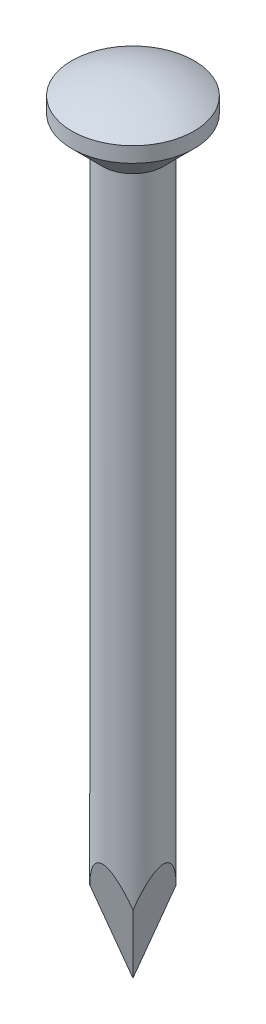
ISO-10303-21;
HEADER;
FILE_DESCRIPTION(('STEP AP214'),'2;1');
FILE_NAME('part.step','',(''),(''),'','','');
FILE_SCHEMA(('AUTOMOTIVE_DESIGN { 1 0 10303 214 1 1 1 1 }'));
ENDSEC;
DATA;
#1=APPLICATION_CONTEXT('core data for automotive mechanical design processes');
#2=APPLICATION_PROTOCOL_DEFINITION('international standard','automotive_design',2000,#1);
#3=PRODUCT_CONTEXT('',#1,'mechanical');
#4=PRODUCT('Part','Part','',(#3));
#5=PRODUCT_RELATED_PRODUCT_CATEGORY('part','',(#4));
#6=PRODUCT_DEFINITION_FORMATION('','',#4);
#7=PRODUCT_DEFINITION_CONTEXT('part definition',#1,'design');
#8=PRODUCT_DEFINITION('design','',#6,#7);
#9=PRODUCT_DEFINITION_SHAPE('','',#8);
#10=(LENGTH_UNIT() NAMED_UNIT(*) SI_UNIT(.MILLI.,.METRE.));
#11=(NAMED_UNIT(*) PLANE_ANGLE_UNIT() SI_UNIT($,.RADIAN.));
#12=(NAMED_UNIT(*) SI_UNIT($,.STERADIAN.) SOLID_ANGLE_UNIT());
#13=UNCERTAINTY_MEASURE_WITH_UNIT(LENGTH_MEASURE(1.E-05),#10,'distance_accuracy_value','');
#14=(GEOMETRIC_REPRESENTATION_CONTEXT(3) GLOBAL_UNCERTAINTY_ASSIGNED_CONTEXT((#13)) GLOBAL_UNIT_ASSIGNED_CONTEXT((#10,
#11,#12)) REPRESENTATION_CONTEXT('',''));
#15=CARTESIAN_POINT('',(0.,0.,0.));
#16=DIRECTION('',(0.,0.,1.));
#17=DIRECTION('',(1.,0.,0.));
#18=AXIS2_PLACEMENT_3D('',#15,#16,#17);
#19=CARTESIAN_POINT('',(0.,0.,0.));
#20=DIRECTION('',(0.,1.,0.));
#21=DIRECTION('',(-1.,0.,0.));
#22=AXIS2_PLACEMENT_3D('',#19,#20,#21);
#23=PLANE('',#22);
#24=DIRECTION('',(0.,0.,1.));
#25=VECTOR('',#24,1.);
#26=CARTESIAN_POINT('',(0.000999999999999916,0.,-2.5));
#27=LINE('',#26,#25);
#28=CARTESIAN_POINT('',(0.000999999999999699,0.,-0.00100000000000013));
#29=VERTEX_POINT('',#28);
#30=CARTESIAN_POINT('',(0.000999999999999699,0.,0.00100000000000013));
#31=VERTEX_POINT('',#30);
#32=EDGE_CURVE('E87',#29,#31,#27,.T.);
#33=ORIENTED_EDGE('',*,*,#32,.T.);
#34=DIRECTION('',(-1.,0.,0.));
#35=VECTOR('',#34,1.);
#36=CARTESIAN_POINT('',(2.5,0.,0.00100000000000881));
#37=LINE('',#36,#35);
#38=CARTESIAN_POINT('',(-0.000999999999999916,0.,0.00100000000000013));
#39=VERTEX_POINT('',#38);
#40=EDGE_CURVE('E79',#31,#39,#37,.T.);
#41=ORIENTED_EDGE('',*,*,#40,.T.);
#42=DIRECTION('',(0.,0.,-1.));
#43=VECTOR('',#42,1.);
#44=CARTESIAN_POINT('',(-0.00100000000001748,0.,2.5));
#45=LINE('',#44,#43);
#46=CARTESIAN_POINT('',(-0.000999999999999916,0.,-0.00100000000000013));
#47=VERTEX_POINT('',#46);
#48=EDGE_CURVE('E68',#39,#47,#45,.T.);
#49=ORIENTED_EDGE('',*,*,#48,.T.);
#50=DIRECTION('',(1.,0.,0.));
#51=VECTOR('',#50,1.);
#52=CARTESIAN_POINT('',(-2.5,0.,-0.00100000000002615));
#53=LINE('',#52,#51);
#54=EDGE_CURVE('E70',#47,#29,#53,.T.);
#55=ORIENTED_EDGE('',*,*,#54,.T.);
#56=EDGE_LOOP('',(#33,#41,#49,#55));
#57=FACE_BOUND('',#56,.T.);
#58=ADVANCED_FACE('F22',(#57),#23,.F.);
#59=CARTESIAN_POINT('',(0.,31.5099229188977,0.));
#60=DIRECTION('',(0.,1.,0.));
#61=DIRECTION('',(-1.,0.,0.));
#62=AXIS2_PLACEMENT_3D('',#59,#60,#61);
#63=CYLINDRICAL_SURFACE('',#62,1.);
#64=CARTESIAN_POINT('',(0.,23.5,0.));
#65=DIRECTION('',(0.,1.,0.));
#66=DIRECTION('',(-1.,0.,0.));
#67=AXIS2_PLACEMENT_3D('',#64,#65,#66);
#68=CIRCLE('',#67,1.);
#69=CARTESIAN_POINT('',(-1.,23.5,0.));
#70=VERTEX_POINT('',#69);
#71=EDGE_CURVE('E95',#70,#70,#68,.T.);
#72=ORIENTED_EDGE('',*,*,#71,.F.);
#73=EDGE_LOOP('',(#72));
#74=FACE_BOUND('',#73,.T.);
#75=CARTESIAN_POINT('',(0.,-0.00373205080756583,0.));
#76=DIRECTION('',(0.,0.258819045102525,-0.965925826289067));
#77=DIRECTION('',(0.,0.965925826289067,0.258819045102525));
#78=AXIS2_PLACEMENT_3D('',#75,#76,#77);
#79=ELLIPSE('',#78,3.86370330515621,1.);
#80=CARTESIAN_POINT('',(-0.707106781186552,2.63522638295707,0.707106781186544));
#81=VERTEX_POINT('',#80);
#82=CARTESIAN_POINT('',(0.707106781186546,2.63522638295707,0.707106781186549));
#83=VERTEX_POINT('',#82);
#84=EDGE_CURVE('E44',#81,#83,#79,.T.);
#85=ORIENTED_EDGE('',*,*,#84,.T.);
#86=CARTESIAN_POINT('',(0.,-0.00373205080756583,0.));
#87=DIRECTION('',(-0.965925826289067,0.258819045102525,0.));
#88=DIRECTION('',(0.258819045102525,0.965925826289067,0.));
#89=AXIS2_PLACEMENT_3D('',#86,#87,#88);
#90=ELLIPSE('',#89,3.86370330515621,1.);
#91=CARTESIAN_POINT('',(0.707106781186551,2.63522638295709,-0.707106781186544));
#92=VERTEX_POINT('',#91);
#93=EDGE_CURVE('E98',#83,#92,#90,.T.);
#94=ORIENTED_EDGE('',*,*,#93,.T.);
#95=CARTESIAN_POINT('',(0.,-0.00373205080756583,0.));
#96=DIRECTION('',(0.,0.258819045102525,0.965925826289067));
#97=DIRECTION('',(0.,0.965925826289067,-0.258819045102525));
#98=AXIS2_PLACEMENT_3D('',#95,#96,#97);
#99=ELLIPSE('',#98,3.86370330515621,1.);
#100=CARTESIAN_POINT('',(-0.707106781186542,2.63522638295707,-0.707106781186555));
#101=VERTEX_POINT('',#100);
#102=EDGE_CURVE('E37',#92,#101,#99,.T.);
#103=ORIENTED_EDGE('',*,*,#102,.T.);
#104=CARTESIAN_POINT('',(0.,-0.00373205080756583,0.));
#105=DIRECTION('',(0.965925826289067,0.258819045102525,0.));
#106=DIRECTION('',(-0.258819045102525,0.965925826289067,0.));
#107=AXIS2_PLACEMENT_3D('',#104,#105,#106);
#108=ELLIPSE('',#107,3.86370330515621,1.);
#109=EDGE_CURVE('E11',#101,#81,#108,.T.);
#110=ORIENTED_EDGE('',*,*,#109,.T.);
#111=EDGE_LOOP('',(#85,#94,#103,#110));
#112=FACE_BOUND('',#111,.T.);
#113=ADVANCED_FACE('F116',(#74,#112),#63,.T.);
#114=CARTESIAN_POINT('',(0.,23.5,0.));
#115=DIRECTION('',(0.,1.,0.));
#116=DIRECTION('',(-1.,0.,0.));
#117=AXIS2_PLACEMENT_3D('',#114,#115,#116);
#118=CONICAL_SURFACE('',#117,1.,0.785398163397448);
#119=CARTESIAN_POINT('',(0.,24.5,0.));
#120=DIRECTION('',(0.,1.,0.));
#121=DIRECTION('',(-1.,0.,0.));
#122=AXIS2_PLACEMENT_3D('',#119,#120,#121);
#123=CIRCLE('',#122,2.);
#124=CARTESIAN_POINT('',(-2.,24.5,0.));
#125=VERTEX_POINT('',#124);
#126=EDGE_CURVE('E92',#125,#125,#123,.T.);
#127=ORIENTED_EDGE('',*,*,#126,.F.);
#128=EDGE_LOOP('',(#127));
#129=FACE_BOUND('',#128,.T.);
#130=ORIENTED_EDGE('',*,*,#71,.T.);
#131=EDGE_LOOP('',(#130));
#132=FACE_BOUND('',#131,.T.);
#133=ADVANCED_FACE('F120',(#129,#132),#118,.T.);
#134=CARTESIAN_POINT('',(0.,31.5099229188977,0.));
#135=DIRECTION('',(0.,1.,0.));
#136=DIRECTION('',(-1.,0.,0.));
#137=AXIS2_PLACEMENT_3D('',#134,#135,#136);
#138=CYLINDRICAL_SURFACE('',#137,2.);
#139=CARTESIAN_POINT('',(0.,25.,0.));
#140=DIRECTION('',(0.,1.,0.));
#141=DIRECTION('',(-1.,0.,0.));
#142=AXIS2_PLACEMENT_3D('',#139,#140,#141);
#143=CIRCLE('',#142,2.);
#144=CARTESIAN_POINT('',(-2.,25.,0.));
#145=VERTEX_POINT('',#144);
#146=EDGE_CURVE('E89',#145,#145,#143,.T.);
#147=ORIENTED_EDGE('',*,*,#146,.F.);
#148=EDGE_LOOP('',(#147));
#149=FACE_BOUND('',#148,.T.);
#150=ORIENTED_EDGE('',*,*,#126,.T.);
#151=EDGE_LOOP('',(#150));
#152=FACE_BOUND('',#151,.T.);
#153=ADVANCED_FACE('F126',(#149,#152),#138,.T.);
#154=CARTESIAN_POINT('',(0.,21.25,0.));
#155=DIRECTION('',(0.,0.,1.));
#156=DIRECTION('',(1.,0.,0.));
#157=AXIS2_PLACEMENT_3D('',#154,#155,#156);
#158=SPHERICAL_SURFACE('',#157,4.25);
#159=CARTESIAN_POINT('',(0.,21.25,0.));
#160=DIRECTION('',(0.,1.,0.));
#161=DIRECTION('',(-1.,0.,0.));
#162=AXIS2_PLACEMENT_3D('',#159,#160,#161);
#163=SPHERICAL_SURFACE('',#162,4.25);
#164=ORIENTED_EDGE('',*,*,#146,.T.);
#165=EDGE_LOOP('',(#164));
#166=FACE_BOUND('',#165,.T.);
#167=ADVANCED_FACE('F24',(#166),#163,.T.);
#168=CARTESIAN_POINT('',(1.,3.72831875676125,-2.5));
#169=DIRECTION('',(-0.965925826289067,0.258819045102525,0.));
#170=DIRECTION('',(-0.258819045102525,-0.965925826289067,0.));
#171=AXIS2_PLACEMENT_3D('',#168,#169,#170);
#172=PLANE('',#171);
#173=ORIENTED_EDGE('',*,*,#93,.F.);
#174=DIRECTION('',(-0.250562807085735,-0.935113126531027,-0.250562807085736));
#175=VECTOR('',#174,1.);
#176=CARTESIAN_POINT('',(0.780263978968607,2.90825276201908,0.78026397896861));
#177=LINE('',#176,#175);
#178=EDGE_CURVE('E30',#83,#31,#177,.T.);
#179=ORIENTED_EDGE('',*,*,#178,.T.);
#180=ORIENTED_EDGE('',*,*,#32,.F.);
#181=DIRECTION('',(0.250562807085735,0.935113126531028,-0.250562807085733));
#182=VECTOR('',#181,1.);
#183=CARTESIAN_POINT('',(1.09417258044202,4.07977561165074,-1.09417258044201));
#184=LINE('',#183,#182);
#185=EDGE_CURVE('E74',#29,#92,#184,.T.);
#186=ORIENTED_EDGE('',*,*,#185,.T.);
#187=EDGE_LOOP('',(#173,#179,#180,#186));
#188=FACE_BOUND('',#187,.T.);
#189=ADVANCED_FACE('F103',(#188),#172,.F.);
#190=CARTESIAN_POINT('',(-1.00000000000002,3.72831875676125,2.49999999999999));
#191=DIRECTION('',(0.965925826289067,0.258819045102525,0.));
#192=DIRECTION('',(-0.258819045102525,0.965925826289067,0.));
#193=AXIS2_PLACEMENT_3D('',#190,#191,#192);
#194=PLANE('',#193);
#195=ORIENTED_EDGE('',*,*,#109,.F.);
#196=DIRECTION('',(0.250562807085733,-0.935113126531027,0.250562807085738));
#197=VECTOR('',#196,1.);
#198=CARTESIAN_POINT('',(-0.780263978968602,2.90825276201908,-0.780263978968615));
#199=LINE('',#198,#197);
#200=EDGE_CURVE('E63',#101,#47,#199,.T.);
#201=ORIENTED_EDGE('',*,*,#200,.T.);
#202=ORIENTED_EDGE('',*,*,#48,.F.);
#203=DIRECTION('',(0.250562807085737,-0.935113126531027,-0.250562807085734));
#204=VECTOR('',#203,1.);
#205=CARTESIAN_POINT('',(-0.780263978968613,2.90825276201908,0.780263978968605));
#206=LINE('',#205,#204);
#207=EDGE_CURVE('E80',#81,#39,#206,.T.);
#208=ORIENTED_EDGE('',*,*,#207,.F.);
#209=EDGE_LOOP('',(#195,#201,#202,#208));
#210=FACE_BOUND('',#209,.T.);
#211=ADVANCED_FACE('F65',(#210),#194,.F.);
#212=CARTESIAN_POINT('',(2.5,3.72831875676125,1.00000000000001));
#213=DIRECTION('',(0.,0.258819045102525,-0.965925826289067));
#214=DIRECTION('',(0.,0.965925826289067,0.258819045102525));
#215=AXIS2_PLACEMENT_3D('',#212,#213,#214);
#216=PLANE('',#215);
#217=ORIENTED_EDGE('',*,*,#207,.T.);
#218=ORIENTED_EDGE('',*,*,#40,.F.);
#219=ORIENTED_EDGE('',*,*,#178,.F.);
#220=ORIENTED_EDGE('',*,*,#84,.F.);
#221=EDGE_LOOP('',(#217,#218,#219,#220));
#222=FACE_BOUND('',#221,.T.);
#223=ADVANCED_FACE('F105',(#222),#216,.F.);
#224=CARTESIAN_POINT('',(-2.49999999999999,3.72831875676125,-1.00000000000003));
#225=DIRECTION('',(0.,0.258819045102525,0.965925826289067));
#226=DIRECTION('',(0.,-0.965925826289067,0.258819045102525));
#227=AXIS2_PLACEMENT_3D('',#224,#225,#226);
#228=PLANE('',#227);
#229=ORIENTED_EDGE('',*,*,#102,.F.);
#230=ORIENTED_EDGE('',*,*,#185,.F.);
#231=ORIENTED_EDGE('',*,*,#54,.F.);
#232=ORIENTED_EDGE('',*,*,#200,.F.);
#233=EDGE_LOOP('',(#229,#230,#231,#232));
#234=FACE_BOUND('',#233,.T.);
#235=ADVANCED_FACE('F73',(#234),#228,.F.);
#236=CLOSED_SHELL('',(#58,#113,#133,#153,#167,#189,#211,#223,#235));
#237=MANIFOLD_SOLID_BREP('B2',#236);
#238=ADVANCED_BREP_SHAPE_REPRESENTATION('',(#18,#237),#14);
#239=SHAPE_DEFINITION_REPRESENTATION(#9,#238);
ENDSEC;
END-ISO-10303-21;
